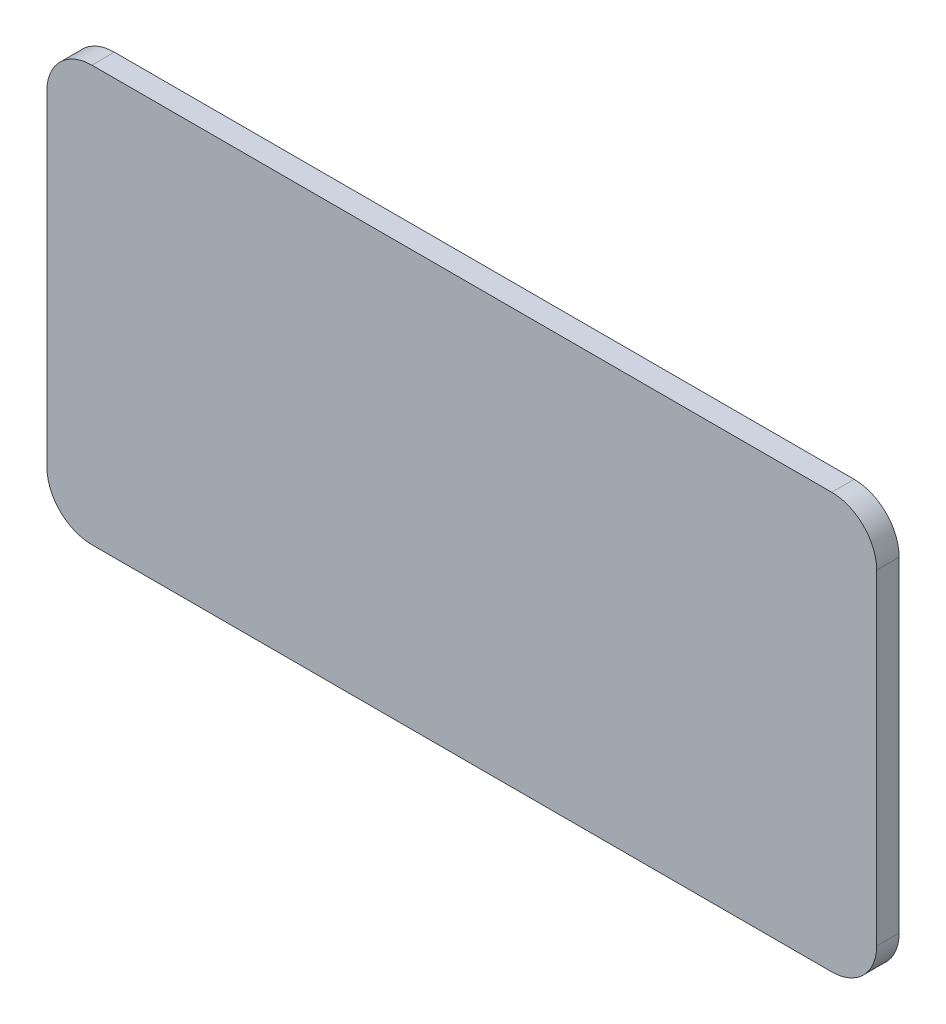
from build123d import *

# Parameters (mm, degrees)
BOSS_EXTRU_1_DEPTH      = 6
ESQUISSE2_W             = 94.917892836
ESQUISSE2_H             = 49.57466912
ENL_V_MAT_EXTRU_1_DEPTH = 3.5


with BuildPart() as part:
    # Esquisse1 → Boss.-Extru.1 (new body)
    with BuildSketch(Plane.XY):
        with BuildLine():
            Line((78.15, 152.2), (-4.15, 152.2))
            ThreePointArc((-4.15, 152.2), (-7.685533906, 150.735533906), (-9.15, 147.2))
            Line((-9.15, 147.2), (-9.15, 111))
            ThreePointArc((-9.15, 111), (-7.685533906, 107.464466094), (-4.15, 106))
            Line((-4.15, 106), (78.15, 106))
            ThreePointArc((78.15, 106), (81.685533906, 107.464466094), (83.15, 111))
            Line((83.15, 111), (83.15, 147.2))
            ThreePointArc((83.15, 147.2), (81.685533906, 150.735533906), (78.15, 152.2))
        make_face()
    extrude(amount=BOSS_EXTRU_1_DEPTH)

    # Esquisse2 → Enl_v. mat.-Extru.1 (cut)
    with BuildSketch(Plane(origin=(0, 0, 0), x_dir=(-1, 0, 0), z_dir=(0, 0, -1))):
        with Locations((-37, 129.1)):
            Rectangle(ESQUISSE2_W, ESQUISSE2_H)
        with BuildLine():
            Line((-72.15, 116), (-1.85, 116))
            ThreePointArc((-1.85, 116), (-1.142893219, 116.292893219), (-0.85, 117))
            Line((-0.85, 117), (-0.85, 141.2))
            ThreePointArc((-0.85, 141.2), (-1.142893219, 141.907106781), (-1.85, 142.2))
            Line((-1.85, 142.2), (-72.15, 142.2))
            ThreePointArc((-72.15, 142.2), (-72.857106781, 141.907106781), (-73.15, 141.2))
            Line((-73.15, 141.2), (-73.15, 117))
            ThreePointArc((-73.15, 117), (-72.857106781, 116.292893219), (-72.15, 116))
        make_face(mode=Mode.SUBTRACT)
    extrude(amount=-ENL_V_MAT_EXTRU_1_DEPTH, mode=Mode.SUBTRACT)


solid = part.part
